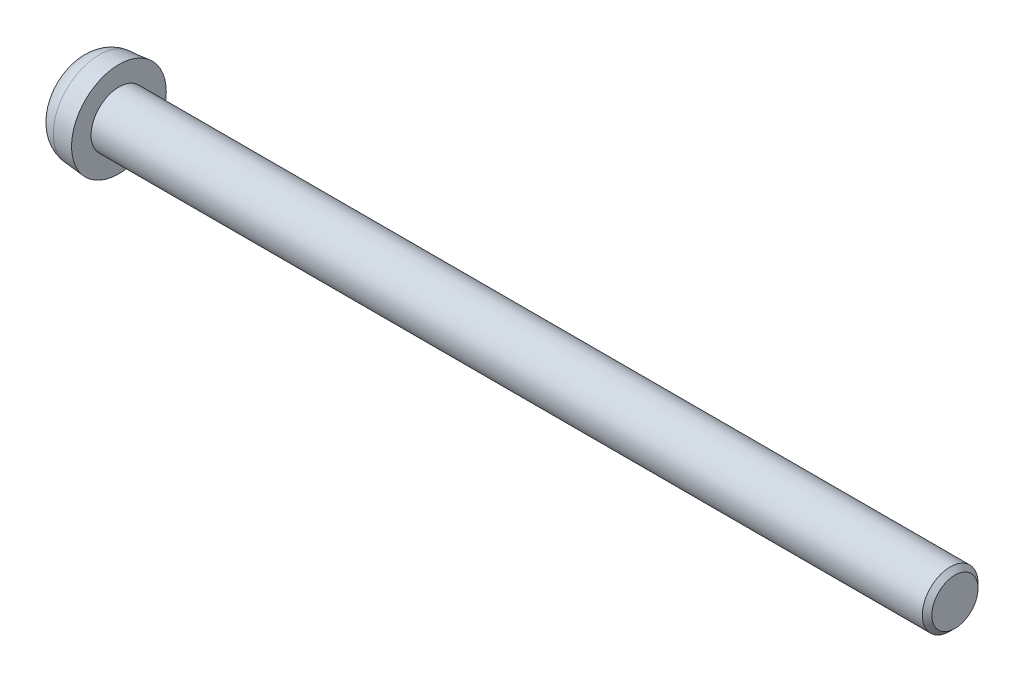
ISO-10303-21;
HEADER;
FILE_DESCRIPTION(('STEP AP214'),'2;1');
FILE_NAME('part.step','',(''),(''),'','','');
FILE_SCHEMA(('AUTOMOTIVE_DESIGN { 1 0 10303 214 1 1 1 1 }'));
ENDSEC;
DATA;
#1=APPLICATION_CONTEXT('core data for automotive mechanical design processes');
#2=APPLICATION_PROTOCOL_DEFINITION('international standard','automotive_design',2000,#1);
#3=PRODUCT_CONTEXT('',#1,'mechanical');
#4=PRODUCT('Part','Part','',(#3));
#5=PRODUCT_RELATED_PRODUCT_CATEGORY('part','',(#4));
#6=PRODUCT_DEFINITION_FORMATION('','',#4);
#7=PRODUCT_DEFINITION_CONTEXT('part definition',#1,'design');
#8=PRODUCT_DEFINITION('design','',#6,#7);
#9=PRODUCT_DEFINITION_SHAPE('','',#8);
#10=(LENGTH_UNIT() NAMED_UNIT(*) SI_UNIT(.MILLI.,.METRE.));
#11=(NAMED_UNIT(*) PLANE_ANGLE_UNIT() SI_UNIT($,.RADIAN.));
#12=(NAMED_UNIT(*) SI_UNIT($,.STERADIAN.) SOLID_ANGLE_UNIT());
#13=UNCERTAINTY_MEASURE_WITH_UNIT(LENGTH_MEASURE(1.E-05),#10,'distance_accuracy_value','');
#14=(GEOMETRIC_REPRESENTATION_CONTEXT(3) GLOBAL_UNCERTAINTY_ASSIGNED_CONTEXT((#13)) GLOBAL_UNIT_ASSIGNED_CONTEXT((#10,
#11,#12)) REPRESENTATION_CONTEXT('',''));
#15=CARTESIAN_POINT('',(0.,0.,0.));
#16=DIRECTION('',(0.,0.,1.));
#17=DIRECTION('',(1.,0.,0.));
#18=AXIS2_PLACEMENT_3D('',#15,#16,#17);
#19=CARTESIAN_POINT('',(-0.257002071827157,0.2375,-0.2375));
#20=DIRECTION('',(0.795355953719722,0.,-0.606142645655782));
#21=DIRECTION('',(-0.606142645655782,0.,-0.795355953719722));
#22=AXIS2_PLACEMENT_3D('',#19,#20,#21);
#23=PLANE('',#22);
#24=DIRECTION('',(-0.606142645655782,0.,-0.795355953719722));
#25=VECTOR('',#24,1.);
#26=CARTESIAN_POINT('',(-0.257002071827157,0.2375,-0.2375));
#27=LINE('',#26,#25);
#28=CARTESIAN_POINT('',(-0.257002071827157,0.2375,-0.2375));
#29=VERTEX_POINT('',#28);
#30=CARTESIAN_POINT('',(-0.8,0.2375,-0.95));
#31=VERTEX_POINT('',#30);
#32=EDGE_CURVE('E272',#29,#31,#27,.T.);
#33=ORIENTED_EDGE('',*,*,#32,.T.);
#34=DIRECTION('',(0.,1.,0.));
#35=VECTOR('',#34,1.);
#36=CARTESIAN_POINT('',(-0.8,0.2375,-0.95));
#37=LINE('',#36,#35);
#38=CARTESIAN_POINT('',(-0.8,-0.2375,-0.95));
#39=VERTEX_POINT('',#38);
#40=EDGE_CURVE('E173',#31,#39,#37,.F.);
#41=ORIENTED_EDGE('',*,*,#40,.T.);
#42=DIRECTION('',(-0.606142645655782,0.,-0.795355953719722));
#43=VECTOR('',#42,1.);
#44=CARTESIAN_POINT('',(-0.257002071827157,-0.2375,-0.2375));
#45=LINE('',#44,#43);
#46=CARTESIAN_POINT('',(-0.257002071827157,-0.2375,-0.2375));
#47=VERTEX_POINT('',#46);
#48=EDGE_CURVE('E170',#47,#39,#45,.T.);
#49=ORIENTED_EDGE('',*,*,#48,.F.);
#50=DIRECTION('',(0.,1.,0.));
#51=VECTOR('',#50,1.);
#52=CARTESIAN_POINT('',(-0.257002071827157,0.,-0.2375));
#53=LINE('',#52,#51);
#54=EDGE_CURVE('E277',#29,#47,#53,.F.);
#55=ORIENTED_EDGE('',*,*,#54,.F.);
#56=EDGE_LOOP('',(#33,#41,#49,#55));
#57=FACE_BOUND('',#56,.T.);
#58=ADVANCED_FACE('F17',(#57),#23,.F.);
#59=CARTESIAN_POINT('',(-0.8,-0.95,0.2375));
#60=DIRECTION('',(0.792405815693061,-0.609994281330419,0.));
#61=DIRECTION('',(0.609994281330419,0.792405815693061,0.));
#62=AXIS2_PLACEMENT_3D('',#59,#60,#61);
#63=PLANE('',#62);
#64=DIRECTION('',(0.609994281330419,0.792405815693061,0.));
#65=VECTOR('',#64,1.);
#66=CARTESIAN_POINT('',(-0.8,-0.95,0.2375));
#67=LINE('',#66,#65);
#68=CARTESIAN_POINT('',(-0.8,-0.95,0.2375));
#69=VERTEX_POINT('',#68);
#70=CARTESIAN_POINT('',(-0.251517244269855,-0.2375,0.2375));
#71=VERTEX_POINT('',#70);
#72=EDGE_CURVE('E144',#69,#71,#67,.T.);
#73=ORIENTED_EDGE('',*,*,#72,.T.);
#74=DIRECTION('',(0.,0.,-1.));
#75=VECTOR('',#74,1.);
#76=CARTESIAN_POINT('',(-0.251517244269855,-0.2375,0.2375));
#77=LINE('',#76,#75);
#78=CARTESIAN_POINT('',(-0.251517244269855,-0.2375,-0.2375));
#79=VERTEX_POINT('',#78);
#80=EDGE_CURVE('E137',#71,#79,#77,.T.);
#81=ORIENTED_EDGE('',*,*,#80,.T.);
#82=DIRECTION('',(0.609994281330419,0.792405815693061,0.));
#83=VECTOR('',#82,1.);
#84=CARTESIAN_POINT('',(-0.8,-0.95,-0.2375));
#85=LINE('',#84,#83);
#86=CARTESIAN_POINT('',(-0.8,-0.95,-0.2375));
#87=VERTEX_POINT('',#86);
#88=EDGE_CURVE('E141',#87,#79,#85,.T.);
#89=ORIENTED_EDGE('',*,*,#88,.F.);
#90=DIRECTION('',(0.,0.,-1.));
#91=VECTOR('',#90,1.);
#92=CARTESIAN_POINT('',(-0.8,-0.95,0.2375));
#93=LINE('',#92,#91);
#94=EDGE_CURVE('E174',#87,#69,#93,.F.);
#95=ORIENTED_EDGE('',*,*,#94,.T.);
#96=EDGE_LOOP('',(#73,#81,#89,#95));
#97=FACE_BOUND('',#96,.T.);
#98=ADVANCED_FACE('F139',(#97),#63,.F.);
#99=CARTESIAN_POINT('',(-0.251517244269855,-0.2375,0.2375));
#100=DIRECTION('',(1.,0.,0.));
#101=DIRECTION('',(0.,0.,-1.));
#102=AXIS2_PLACEMENT_3D('',#99,#100,#101);
#103=PLANE('',#102);
#104=DIRECTION('',(0.,1.,0.));
#105=VECTOR('',#104,1.);
#106=CARTESIAN_POINT('',(-0.251517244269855,0.,0.2375));
#107=LINE('',#106,#105);
#108=CARTESIAN_POINT('',(-0.251517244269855,0.2375,0.2375));
#109=VERTEX_POINT('',#108);
#110=EDGE_CURVE('E251',#71,#109,#107,.T.);
#111=ORIENTED_EDGE('',*,*,#110,.T.);
#112=DIRECTION('',(0.,0.,1.));
#113=VECTOR('',#112,1.);
#114=CARTESIAN_POINT('',(-0.251517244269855,0.2375,0.2375));
#115=LINE('',#114,#113);
#116=CARTESIAN_POINT('',(-0.251517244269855,0.2375,-0.2375));
#117=VERTEX_POINT('',#116);
#118=EDGE_CURVE('E147',#109,#117,#115,.F.);
#119=ORIENTED_EDGE('',*,*,#118,.T.);
#120=DIRECTION('',(0.,1.,0.));
#121=VECTOR('',#120,1.);
#122=CARTESIAN_POINT('',(-0.251517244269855,0.,-0.2375));
#123=LINE('',#122,#121);
#124=EDGE_CURVE('E150',#79,#117,#123,.T.);
#125=ORIENTED_EDGE('',*,*,#124,.F.);
#126=ORIENTED_EDGE('',*,*,#80,.F.);
#127=EDGE_LOOP('',(#111,#119,#125,#126));
#128=FACE_BOUND('',#127,.T.);
#129=ADVANCED_FACE('F151',(#128),#103,.F.);
#130=CARTESIAN_POINT('',(-0.251517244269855,0.2375,0.2375));
#131=DIRECTION('',(0.792405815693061,0.609994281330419,0.));
#132=DIRECTION('',(-0.609994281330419,0.792405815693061,0.));
#133=AXIS2_PLACEMENT_3D('',#130,#131,#132);
#134=PLANE('',#133);
#135=DIRECTION('',(-0.609994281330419,0.792405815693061,0.));
#136=VECTOR('',#135,1.);
#137=CARTESIAN_POINT('',(-0.251517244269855,0.2375,0.2375));
#138=LINE('',#137,#136);
#139=CARTESIAN_POINT('',(-0.8,0.95,0.2375));
#140=VERTEX_POINT('',#139);
#141=EDGE_CURVE('E249',#109,#140,#138,.T.);
#142=ORIENTED_EDGE('',*,*,#141,.T.);
#143=DIRECTION('',(0.,0.,1.));
#144=VECTOR('',#143,1.);
#145=CARTESIAN_POINT('',(-0.8,0.95,0.2375));
#146=LINE('',#145,#144);
#147=CARTESIAN_POINT('',(-0.8,0.95,-0.2375));
#148=VERTEX_POINT('',#147);
#149=EDGE_CURVE('E243',#140,#148,#146,.F.);
#150=ORIENTED_EDGE('',*,*,#149,.T.);
#151=DIRECTION('',(-0.609994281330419,0.792405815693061,0.));
#152=VECTOR('',#151,1.);
#153=CARTESIAN_POINT('',(-0.251517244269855,0.2375,-0.2375));
#154=LINE('',#153,#152);
#155=EDGE_CURVE('E156',#117,#148,#154,.T.);
#156=ORIENTED_EDGE('',*,*,#155,.F.);
#157=ORIENTED_EDGE('',*,*,#118,.F.);
#158=EDGE_LOOP('',(#142,#150,#156,#157));
#159=FACE_BOUND('',#158,.T.);
#160=ADVANCED_FACE('F457',(#159),#134,.F.);
#161=CARTESIAN_POINT('',(-0.8,0.2375,0.95));
#162=DIRECTION('',(0.795355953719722,0.,0.606142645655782));
#163=DIRECTION('',(0.606142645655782,0.,-0.795355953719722));
#164=AXIS2_PLACEMENT_3D('',#161,#162,#163);
#165=PLANE('',#164);
#166=DIRECTION('',(0.606142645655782,0.,-0.795355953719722));
#167=VECTOR('',#166,1.);
#168=CARTESIAN_POINT('',(-0.8,0.2375,0.95));
#169=LINE('',#168,#167);
#170=CARTESIAN_POINT('',(-0.8,0.2375,0.95));
#171=VERTEX_POINT('',#170);
#172=CARTESIAN_POINT('',(-0.257002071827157,0.2375,0.2375));
#173=VERTEX_POINT('',#172);
#174=EDGE_CURVE('E224',#171,#173,#169,.T.);
#175=ORIENTED_EDGE('',*,*,#174,.T.);
#176=DIRECTION('',(0.,1.,0.));
#177=VECTOR('',#176,1.);
#178=CARTESIAN_POINT('',(-0.257002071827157,0.,0.2375));
#179=LINE('',#178,#177);
#180=CARTESIAN_POINT('',(-0.257002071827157,-0.2375,0.2375));
#181=VERTEX_POINT('',#180);
#182=EDGE_CURVE('E237',#173,#181,#179,.F.);
#183=ORIENTED_EDGE('',*,*,#182,.T.);
#184=DIRECTION('',(0.606142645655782,0.,-0.795355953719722));
#185=VECTOR('',#184,1.);
#186=CARTESIAN_POINT('',(-0.8,-0.2375,0.95));
#187=LINE('',#186,#185);
#188=CARTESIAN_POINT('',(-0.8,-0.2375,0.95));
#189=VERTEX_POINT('',#188);
#190=EDGE_CURVE('E233',#189,#181,#187,.T.);
#191=ORIENTED_EDGE('',*,*,#190,.F.);
#192=DIRECTION('',(0.,1.,0.));
#193=VECTOR('',#192,1.);
#194=CARTESIAN_POINT('',(-0.8,0.2375,0.95));
#195=LINE('',#194,#193);
#196=EDGE_CURVE('E94',#189,#171,#195,.T.);
#197=ORIENTED_EDGE('',*,*,#196,.T.);
#198=EDGE_LOOP('',(#175,#183,#191,#197));
#199=FACE_BOUND('',#198,.T.);
#200=ADVANCED_FACE('F454',(#199),#165,.F.);
#201=CARTESIAN_POINT('',(0.,-0.2375,0.));
#202=DIRECTION('',(0.,1.,0.));
#203=DIRECTION('',(0.,0.,1.));
#204=AXIS2_PLACEMENT_3D('',#201,#202,#203);
#205=PLANE('',#204);
#206=ORIENTED_EDGE('',*,*,#190,.T.);
#207=DIRECTION('',(1.,0.,0.));
#208=VECTOR('',#207,1.);
#209=CARTESIAN_POINT('',(0.,-0.2375,0.2375));
#210=LINE('',#209,#208);
#211=CARTESIAN_POINT('',(-1.58232422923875,-0.2375,0.2375));
#212=VERTEX_POINT('',#211);
#213=EDGE_CURVE('E78',#181,#212,#210,.F.);
#214=ORIENTED_EDGE('',*,*,#213,.T.);
#215=CARTESIAN_POINT('',(-1.44648875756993,-0.2375,0.950000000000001));
#216=CARTESIAN_POINT('',(-1.47856979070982,-0.237500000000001,0.847213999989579));
#217=CARTESIAN_POINT('',(-1.50540901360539,-0.237500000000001,0.742751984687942));
#218=CARTESIAN_POINT('',(-1.54828837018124,-0.237499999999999,0.532255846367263));
#219=CARTESIAN_POINT('',(-1.56438930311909,-0.237499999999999,0.426234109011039));
#220=CARTESIAN_POINT('',(-1.57787557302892,-0.237499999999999,0.292340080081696));
#221=CARTESIAN_POINT('',(-1.58027812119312,-0.237499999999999,0.264931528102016));
#222=CARTESIAN_POINT('',(-1.58232422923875,-0.2375,0.237499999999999));
#223=B_SPLINE_CURVE_WITH_KNOTS('',3,(#215,#216,#217,#218,#219,#220,#221,#222),.UNSPECIFIED.,.F.,
.F.,(4,2,2,4),(0.,0.322970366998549,0.644096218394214,0.726627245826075),.UNSPECIFIED.);
#224=CARTESIAN_POINT('',(-1.44648875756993,-0.2375,0.950000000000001));
#225=VERTEX_POINT('',#224);
#226=EDGE_CURVE('E21',#225,#212,#223,.T.);
#227=ORIENTED_EDGE('',*,*,#226,.F.);
#228=DIRECTION('',(1.,0.,0.));
#229=VECTOR('',#228,1.);
#230=CARTESIAN_POINT('',(-1.68,-0.2375,0.95));
#231=LINE('',#230,#229);
#232=EDGE_CURVE('E226',#225,#189,#231,.T.);
#233=ORIENTED_EDGE('',*,*,#232,.T.);
#234=EDGE_LOOP('',(#206,#214,#227,#233));
#235=FACE_BOUND('',#234,.T.);
#236=ADVANCED_FACE('F320',(#235),#205,.T.);
#237=CARTESIAN_POINT('',(-1.76,-0.95,0.2375));
#238=DIRECTION('',(0.,-1.,0.));
#239=DIRECTION('',(0.,0.,-1.));
#240=AXIS2_PLACEMENT_3D('',#237,#238,#239);
#241=PLANE('',#240);
#242=ORIENTED_EDGE('',*,*,#94,.F.);
#243=DIRECTION('',(1.,0.,0.));
#244=VECTOR('',#243,1.);
#245=CARTESIAN_POINT('',(0.,-0.95,-0.2375));
#246=LINE('',#245,#244);
#247=CARTESIAN_POINT('',(-1.44648875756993,-0.950000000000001,-0.2375));
#248=VERTEX_POINT('',#247);
#249=EDGE_CURVE('E161',#248,#87,#246,.T.);
#250=ORIENTED_EDGE('',*,*,#249,.F.);
#251=CARTESIAN_POINT('',(-1.44648875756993,-0.95,0.2375));
#252=CARTESIAN_POINT('',(-1.45265113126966,-0.95,0.158333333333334));
#253=CARTESIAN_POINT('',(-1.45573231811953,-0.95,0.0791666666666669));
#254=CARTESIAN_POINT('',(-1.45573231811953,-0.95,-0.0791666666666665));
#255=CARTESIAN_POINT('',(-1.45265113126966,-0.95,-0.158333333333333));
#256=CARTESIAN_POINT('',(-1.44648875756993,-0.95,-0.2375));
#257=B_SPLINE_CURVE_WITH_KNOTS('',3,(#251,#252,#253,#254,#255,#256),.UNSPECIFIED.,.F.,.F.,(4,2,
4),(0.,0.237679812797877,0.475359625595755),.UNSPECIFIED.);
#258=CARTESIAN_POINT('',(-1.44648875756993,-0.95,0.2375));
#259=VERTEX_POINT('',#258);
#260=EDGE_CURVE('E357',#259,#248,#257,.T.);
#261=ORIENTED_EDGE('',*,*,#260,.F.);
#262=DIRECTION('',(1.,0.,0.));
#263=VECTOR('',#262,1.);
#264=CARTESIAN_POINT('',(0.,-0.95,0.2375));
#265=LINE('',#264,#263);
#266=EDGE_CURVE('E263',#259,#69,#265,.T.);
#267=ORIENTED_EDGE('',*,*,#266,.T.);
#268=EDGE_LOOP('',(#242,#250,#261,#267));
#269=FACE_BOUND('',#268,.T.);
#270=ADVANCED_FACE('F369',(#269),#241,.F.);
#271=CARTESIAN_POINT('',(0.,-0.2375,0.));
#272=DIRECTION('',(0.,1.,0.));
#273=DIRECTION('',(0.,0.,1.));
#274=AXIS2_PLACEMENT_3D('',#271,#272,#273);
#275=PLANE('',#274);
#276=CARTESIAN_POINT('',(-1.58232422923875,-0.2375,-0.237500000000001));
#277=CARTESIAN_POINT('',(-1.57433797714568,-0.2375,-0.344879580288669));
#278=CARTESIAN_POINT('',(-1.56086094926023,-0.2375,-0.451889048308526));
#279=CARTESIAN_POINT('',(-1.52328687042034,-0.2375,-0.66339661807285));
#280=CARTESIAN_POINT('',(-1.49925091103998,-0.2375,-0.767905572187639));
#281=CARTESIAN_POINT('',(-1.46252891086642,-0.2375,-0.897369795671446));
#282=CARTESIAN_POINT('',(-1.4546787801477,-0.2375,-0.923739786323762));
#283=CARTESIAN_POINT('',(-1.44648875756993,-0.2375,-0.950000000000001));
#284=B_SPLINE_CURVE_WITH_KNOTS('',3,(#276,#277,#278,#279,#280,#281,#282,#283),.UNSPECIFIED.,.F.,
.F.,(4,2,2,4),(0.,0.322970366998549,0.644096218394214,0.726627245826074),.UNSPECIFIED.);
#285=CARTESIAN_POINT('',(-1.58232422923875,-0.2375,-0.2375));
#286=VERTEX_POINT('',#285);
#287=CARTESIAN_POINT('',(-1.44648875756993,-0.2375,-0.95));
#288=VERTEX_POINT('',#287);
#289=EDGE_CURVE('E384',#286,#288,#284,.T.);
#290=ORIENTED_EDGE('',*,*,#289,.F.);
#291=DIRECTION('',(1.,0.,0.));
#292=VECTOR('',#291,1.);
#293=CARTESIAN_POINT('',(0.,-0.2375,-0.2375));
#294=LINE('',#293,#292);
#295=EDGE_CURVE('E163',#47,#286,#294,.F.);
#296=ORIENTED_EDGE('',*,*,#295,.F.);
#297=ORIENTED_EDGE('',*,*,#48,.T.);
#298=DIRECTION('',(-1.,0.,0.));
#299=VECTOR('',#298,1.);
#300=CARTESIAN_POINT('',(-0.8,-0.2375,-0.95));
#301=LINE('',#300,#299);
#302=EDGE_CURVE('E178',#39,#288,#301,.T.);
#303=ORIENTED_EDGE('',*,*,#302,.T.);
#304=EDGE_LOOP('',(#290,#296,#297,#303));
#305=FACE_BOUND('',#304,.T.);
#306=ADVANCED_FACE('F373',(#305),#275,.T.);
#307=CARTESIAN_POINT('',(-0.8,0.2375,-0.95));
#308=DIRECTION('',(0.,0.,-1.));
#309=DIRECTION('',(-1.,0.,0.));
#310=AXIS2_PLACEMENT_3D('',#307,#308,#309);
#311=PLANE('',#310);
#312=CARTESIAN_POINT('',(-1.44648875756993,-0.2375,-0.95));
#313=CARTESIAN_POINT('',(-1.45265113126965,-0.158333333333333,-0.95));
#314=CARTESIAN_POINT('',(-1.4557323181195,-0.0791666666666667,-0.950000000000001));
#315=CARTESIAN_POINT('',(-1.4557323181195,0.0791666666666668,-0.950000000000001));
#316=CARTESIAN_POINT('',(-1.45265113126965,0.158333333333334,-0.95));
#317=CARTESIAN_POINT('',(-1.44648875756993,0.2375,-0.95));
#318=B_SPLINE_CURVE_WITH_KNOTS('',3,(#312,#313,#314,#315,#316,#317),.UNSPECIFIED.,.F.,.F.,(4,2,
4),(0.,0.237679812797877,0.475359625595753),.UNSPECIFIED.);
#319=CARTESIAN_POINT('',(-1.44648875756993,0.2375,-0.950000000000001));
#320=VERTEX_POINT('',#319);
#321=EDGE_CURVE('E389',#288,#320,#318,.T.);
#322=ORIENTED_EDGE('',*,*,#321,.F.);
#323=ORIENTED_EDGE('',*,*,#302,.F.);
#324=ORIENTED_EDGE('',*,*,#40,.F.);
#325=DIRECTION('',(1.,0.,0.));
#326=VECTOR('',#325,1.);
#327=CARTESIAN_POINT('',(0.,0.2375,-0.95));
#328=LINE('',#327,#326);
#329=EDGE_CURVE('E274',#31,#320,#328,.F.);
#330=ORIENTED_EDGE('',*,*,#329,.T.);
#331=EDGE_LOOP('',(#322,#323,#324,#330));
#332=FACE_BOUND('',#331,.T.);
#333=ADVANCED_FACE('F380',(#332),#311,.F.);
#334=CARTESIAN_POINT('',(0.,0.2375,0.));
#335=DIRECTION('',(0.,1.,0.));
#336=DIRECTION('',(0.,0.,1.));
#337=AXIS2_PLACEMENT_3D('',#334,#335,#336);
#338=PLANE('',#337);
#339=ORIENTED_EDGE('',*,*,#329,.F.);
#340=ORIENTED_EDGE('',*,*,#32,.F.);
#341=DIRECTION('',(1.,0.,0.));
#342=VECTOR('',#341,1.);
#343=CARTESIAN_POINT('',(0.,0.2375,-0.2375));
#344=LINE('',#343,#342);
#345=CARTESIAN_POINT('',(-1.58232422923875,0.2375,-0.2375));
#346=VERTEX_POINT('',#345);
#347=EDGE_CURVE('E246',#346,#29,#344,.T.);
#348=ORIENTED_EDGE('',*,*,#347,.F.);
#349=CARTESIAN_POINT('',(-1.44648875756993,0.2375,-0.950000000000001));
#350=CARTESIAN_POINT('',(-1.47856979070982,0.237500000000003,-0.847213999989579));
#351=CARTESIAN_POINT('',(-1.50540901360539,0.237500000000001,-0.742751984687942));
#352=CARTESIAN_POINT('',(-1.54828837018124,0.237499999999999,-0.532255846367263));
#353=CARTESIAN_POINT('',(-1.56438930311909,0.237499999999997,-0.426234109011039));
#354=CARTESIAN_POINT('',(-1.57787557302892,0.237499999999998,-0.292340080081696));
#355=CARTESIAN_POINT('',(-1.58027812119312,0.237499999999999,-0.264931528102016));
#356=CARTESIAN_POINT('',(-1.58232422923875,0.237499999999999,-0.237499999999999));
#357=B_SPLINE_CURVE_WITH_KNOTS('',3,(#349,#350,#351,#352,#353,#354,#355,#356),.UNSPECIFIED.,.F.,
.F.,(4,2,2,4),(0.,0.322970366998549,0.644096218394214,0.726627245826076),.UNSPECIFIED.);
#358=EDGE_CURVE('E395',#320,#346,#357,.T.);
#359=ORIENTED_EDGE('',*,*,#358,.F.);
#360=EDGE_LOOP('',(#339,#340,#348,#359));
#361=FACE_BOUND('',#360,.T.);
#362=ADVANCED_FACE('F403',(#361),#338,.F.);
#363=CARTESIAN_POINT('',(0.,0.,-0.2375));
#364=DIRECTION('',(0.,0.,1.));
#365=DIRECTION('',(1.,0.,0.));
#366=AXIS2_PLACEMENT_3D('',#363,#364,#365);
#367=PLANE('',#366);
#368=CARTESIAN_POINT('',(-1.58232422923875,0.2375,-0.2375));
#369=CARTESIAN_POINT('',(-1.57433797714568,0.344879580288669,-0.2375));
#370=CARTESIAN_POINT('',(-1.56086094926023,0.451889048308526,-0.2375));
#371=CARTESIAN_POINT('',(-1.52328687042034,0.663396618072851,-0.2375));
#372=CARTESIAN_POINT('',(-1.49925091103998,0.767905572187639,-0.2375));
#373=CARTESIAN_POINT('',(-1.46252891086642,0.897369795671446,-0.2375));
#374=CARTESIAN_POINT('',(-1.4546787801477,0.923739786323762,-0.2375));
#375=CARTESIAN_POINT('',(-1.44648875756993,0.950000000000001,-0.2375));
#376=B_SPLINE_CURVE_WITH_KNOTS('',3,(#368,#369,#370,#371,#372,#373,#374,#375),.UNSPECIFIED.,.F.,
.F.,(4,2,2,4),(0.,0.322970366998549,0.644096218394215,0.726627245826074),.UNSPECIFIED.);
#377=CARTESIAN_POINT('',(-1.44648875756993,0.95,-0.2375));
#378=VERTEX_POINT('',#377);
#379=EDGE_CURVE('E330',#346,#378,#376,.T.);
#380=ORIENTED_EDGE('',*,*,#379,.F.);
#381=ORIENTED_EDGE('',*,*,#347,.T.);
#382=ORIENTED_EDGE('',*,*,#54,.T.);
#383=ORIENTED_EDGE('',*,*,#295,.T.);
#384=CARTESIAN_POINT('',(-1.44648875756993,-0.950000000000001,-0.2375));
#385=CARTESIAN_POINT('',(-1.47856979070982,-0.847213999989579,-0.237500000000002));
#386=CARTESIAN_POINT('',(-1.50540901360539,-0.742751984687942,-0.237500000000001));
#387=CARTESIAN_POINT('',(-1.54828837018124,-0.532255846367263,-0.237499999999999));
#388=CARTESIAN_POINT('',(-1.56438930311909,-0.426234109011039,-0.237499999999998));
#389=CARTESIAN_POINT('',(-1.57787557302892,-0.292340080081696,-0.237499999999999));
#390=CARTESIAN_POINT('',(-1.58027812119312,-0.264931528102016,-0.237499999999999));
#391=CARTESIAN_POINT('',(-1.58232422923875,-0.237499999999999,-0.2375));
#392=B_SPLINE_CURVE_WITH_KNOTS('',3,(#384,#385,#386,#387,#388,#389,#390,#391),.UNSPECIFIED.,.F.,
.F.,(4,2,2,4),(0.,0.322970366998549,0.644096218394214,0.726627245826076),.UNSPECIFIED.);
#393=EDGE_CURVE('E364',#248,#286,#392,.T.);
#394=ORIENTED_EDGE('',*,*,#393,.F.);
#395=ORIENTED_EDGE('',*,*,#249,.T.);
#396=ORIENTED_EDGE('',*,*,#88,.T.);
#397=ORIENTED_EDGE('',*,*,#124,.T.);
#398=ORIENTED_EDGE('',*,*,#155,.T.);
#399=DIRECTION('',(1.,0.,0.));
#400=VECTOR('',#399,1.);
#401=CARTESIAN_POINT('',(-0.8,0.95,-0.2375));
#402=LINE('',#401,#400);
#403=EDGE_CURVE('E245',#148,#378,#402,.F.);
#404=ORIENTED_EDGE('',*,*,#403,.T.);
#405=EDGE_LOOP('',(#380,#381,#382,#383,#394,#395,#396,#397,#398,#404));
#406=FACE_BOUND('',#405,.T.);
#407=ADVANCED_FACE('F159',(#406),#367,.T.);
#408=CARTESIAN_POINT('',(-0.8,0.95,0.2375));
#409=DIRECTION('',(0.,1.,0.));
#410=DIRECTION('',(0.,0.,1.));
#411=AXIS2_PLACEMENT_3D('',#408,#409,#410);
#412=PLANE('',#411);
#413=ORIENTED_EDGE('',*,*,#149,.F.);
#414=DIRECTION('',(1.,0.,0.));
#415=VECTOR('',#414,1.);
#416=CARTESIAN_POINT('',(0.,0.95,0.2375));
#417=LINE('',#416,#415);
#418=CARTESIAN_POINT('',(-1.44648875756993,0.950000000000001,0.2375));
#419=VERTEX_POINT('',#418);
#420=EDGE_CURVE('E240',#140,#419,#417,.F.);
#421=ORIENTED_EDGE('',*,*,#420,.T.);
#422=CARTESIAN_POINT('',(-1.44648875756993,0.95,-0.2375));
#423=CARTESIAN_POINT('',(-1.45265113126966,0.95,-0.158333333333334));
#424=CARTESIAN_POINT('',(-1.45573231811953,0.95,-0.0791666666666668));
#425=CARTESIAN_POINT('',(-1.45573231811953,0.95,0.0791666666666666));
#426=CARTESIAN_POINT('',(-1.45265113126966,0.95,0.158333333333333));
#427=CARTESIAN_POINT('',(-1.44648875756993,0.95,0.2375));
#428=B_SPLINE_CURVE_WITH_KNOTS('',3,(#422,#423,#424,#425,#426,#427),.UNSPECIFIED.,.F.,.F.,(4,2,
4),(0.,0.237679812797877,0.475359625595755),.UNSPECIFIED.);
#429=EDGE_CURVE('E329',#378,#419,#428,.T.);
#430=ORIENTED_EDGE('',*,*,#429,.F.);
#431=ORIENTED_EDGE('',*,*,#403,.F.);
#432=EDGE_LOOP('',(#413,#421,#430,#431));
#433=FACE_BOUND('',#432,.T.);
#434=ADVANCED_FACE('F345',(#433),#412,.F.);
#435=CARTESIAN_POINT('',(0.,0.,0.2375));
#436=DIRECTION('',(0.,0.,1.));
#437=DIRECTION('',(1.,0.,0.));
#438=AXIS2_PLACEMENT_3D('',#435,#436,#437);
#439=PLANE('',#438);
#440=DIRECTION('',(1.,0.,0.));
#441=VECTOR('',#440,1.);
#442=CARTESIAN_POINT('',(0.,0.2375,0.2375));
#443=LINE('',#442,#441);
#444=CARTESIAN_POINT('',(-1.58232422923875,0.2375,0.2375));
#445=VERTEX_POINT('',#444);
#446=EDGE_CURVE('E227',#173,#445,#443,.F.);
#447=ORIENTED_EDGE('',*,*,#446,.T.);
#448=CARTESIAN_POINT('',(-1.44648875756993,0.950000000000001,0.2375));
#449=CARTESIAN_POINT('',(-1.47856979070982,0.847213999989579,0.237500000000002));
#450=CARTESIAN_POINT('',(-1.50540901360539,0.742751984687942,0.237500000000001));
#451=CARTESIAN_POINT('',(-1.54828837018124,0.532255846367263,0.237499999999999));
#452=CARTESIAN_POINT('',(-1.56438930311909,0.426234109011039,0.237499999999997));
#453=CARTESIAN_POINT('',(-1.57787557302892,0.292340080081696,0.237499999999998));
#454=CARTESIAN_POINT('',(-1.58027812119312,0.264931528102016,0.237499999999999));
#455=CARTESIAN_POINT('',(-1.58232422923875,0.237499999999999,0.237499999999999));
#456=B_SPLINE_CURVE_WITH_KNOTS('',3,(#448,#449,#450,#451,#452,#453,#454,#455),.UNSPECIFIED.,.F.,
.F.,(4,2,2,4),(0.,0.322970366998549,0.644096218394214,0.726627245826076),.UNSPECIFIED.);
#457=EDGE_CURVE('E327',#419,#445,#456,.T.);
#458=ORIENTED_EDGE('',*,*,#457,.F.);
#459=ORIENTED_EDGE('',*,*,#420,.F.);
#460=ORIENTED_EDGE('',*,*,#141,.F.);
#461=ORIENTED_EDGE('',*,*,#110,.F.);
#462=ORIENTED_EDGE('',*,*,#72,.F.);
#463=ORIENTED_EDGE('',*,*,#266,.F.);
#464=CARTESIAN_POINT('',(-1.58232422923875,-0.2375,0.237500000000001));
#465=CARTESIAN_POINT('',(-1.57433797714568,-0.344879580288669,0.2375));
#466=CARTESIAN_POINT('',(-1.56086094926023,-0.451889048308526,0.2375));
#467=CARTESIAN_POINT('',(-1.52328687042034,-0.663396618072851,0.2375));
#468=CARTESIAN_POINT('',(-1.49925091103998,-0.767905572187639,0.2375));
#469=CARTESIAN_POINT('',(-1.46252891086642,-0.897369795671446,0.2375));
#470=CARTESIAN_POINT('',(-1.4546787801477,-0.923739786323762,0.2375));
#471=CARTESIAN_POINT('',(-1.44648875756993,-0.950000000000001,0.2375));
#472=B_SPLINE_CURVE_WITH_KNOTS('',3,(#464,#465,#466,#467,#468,#469,#470,#471),.UNSPECIFIED.,.F.,
.F.,(4,2,2,4),(0.,0.322970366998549,0.644096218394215,0.726627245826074),.UNSPECIFIED.);
#473=EDGE_CURVE('E351',#212,#259,#472,.T.);
#474=ORIENTED_EDGE('',*,*,#473,.F.);
#475=ORIENTED_EDGE('',*,*,#213,.F.);
#476=ORIENTED_EDGE('',*,*,#182,.F.);
#477=EDGE_LOOP('',(#447,#458,#459,#460,#461,#462,#463,#474,#475,#476));
#478=FACE_BOUND('',#477,.T.);
#479=ADVANCED_FACE('F341',(#478),#439,.F.);
#480=CARTESIAN_POINT('',(0.,0.2375,0.));
#481=DIRECTION('',(0.,1.,0.));
#482=DIRECTION('',(0.,0.,1.));
#483=AXIS2_PLACEMENT_3D('',#480,#481,#482);
#484=PLANE('',#483);
#485=DIRECTION('',(1.,0.,0.));
#486=VECTOR('',#485,1.);
#487=CARTESIAN_POINT('',(-1.68,0.2375,0.95));
#488=LINE('',#487,#486);
#489=CARTESIAN_POINT('',(-1.44648875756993,0.2375,0.95));
#490=VERTEX_POINT('',#489);
#491=EDGE_CURVE('E41',#171,#490,#488,.F.);
#492=ORIENTED_EDGE('',*,*,#491,.T.);
#493=CARTESIAN_POINT('',(-1.58232422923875,0.2375,0.2375));
#494=CARTESIAN_POINT('',(-1.57433797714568,0.2375,0.344879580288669));
#495=CARTESIAN_POINT('',(-1.56086094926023,0.2375,0.451889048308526));
#496=CARTESIAN_POINT('',(-1.52328687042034,0.2375,0.663396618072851));
#497=CARTESIAN_POINT('',(-1.49925091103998,0.2375,0.767905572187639));
#498=CARTESIAN_POINT('',(-1.46252891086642,0.2375,0.897369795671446));
#499=CARTESIAN_POINT('',(-1.4546787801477,0.2375,0.923739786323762));
#500=CARTESIAN_POINT('',(-1.44648875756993,0.2375,0.950000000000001));
#501=B_SPLINE_CURVE_WITH_KNOTS('',3,(#493,#494,#495,#496,#497,#498,#499,#500),.UNSPECIFIED.,.F.,
.F.,(4,2,2,4),(0.,0.322970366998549,0.644096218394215,0.726627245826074),.UNSPECIFIED.);
#502=EDGE_CURVE('E194',#445,#490,#501,.T.);
#503=ORIENTED_EDGE('',*,*,#502,.F.);
#504=ORIENTED_EDGE('',*,*,#446,.F.);
#505=ORIENTED_EDGE('',*,*,#174,.F.);
#506=EDGE_LOOP('',(#492,#503,#504,#505));
#507=FACE_BOUND('',#506,.T.);
#508=ADVANCED_FACE('F344',(#507),#484,.F.);
#509=CARTESIAN_POINT('',(-1.68,0.2375,0.95));
#510=DIRECTION('',(0.,0.,1.));
#511=DIRECTION('',(1.,0.,0.));
#512=AXIS2_PLACEMENT_3D('',#509,#510,#511);
#513=PLANE('',#512);
#514=CARTESIAN_POINT('',(-1.44648875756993,0.237500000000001,0.95));
#515=CARTESIAN_POINT('',(-1.45265113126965,0.158333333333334,0.949999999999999));
#516=CARTESIAN_POINT('',(-1.4557323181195,0.0791666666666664,0.949999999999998));
#517=CARTESIAN_POINT('',(-1.4557323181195,-0.0791666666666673,0.949999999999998));
#518=CARTESIAN_POINT('',(-1.45265113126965,-0.158333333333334,0.949999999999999));
#519=CARTESIAN_POINT('',(-1.44648875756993,-0.2375,0.95));
#520=B_SPLINE_CURVE_WITH_KNOTS('',3,(#514,#515,#516,#517,#518,#519),.UNSPECIFIED.,.F.,.F.,(4,2,
4),(0.,0.237679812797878,0.475359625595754),.UNSPECIFIED.);
#521=EDGE_CURVE('E85',#490,#225,#520,.T.);
#522=ORIENTED_EDGE('',*,*,#521,.F.);
#523=ORIENTED_EDGE('',*,*,#491,.F.);
#524=ORIENTED_EDGE('',*,*,#196,.F.);
#525=ORIENTED_EDGE('',*,*,#232,.F.);
#526=EDGE_LOOP('',(#522,#523,#524,#525));
#527=FACE_BOUND('',#526,.T.);
#528=ADVANCED_FACE('F200',(#527),#513,.F.);
#529=CARTESIAN_POINT('',(1.6,0.,0.));
#530=DIRECTION('',(1.,0.,0.));
#531=DIRECTION('',(0.,0.,-1.));
#532=AXIS2_PLACEMENT_3D('',#529,#530,#531);
#533=SPHERICAL_SURFACE('',#532,3.2);
#534=ORIENTED_EDGE('',*,*,#289,.T.);
#535=ORIENTED_EDGE('',*,*,#321,.T.);
#536=ORIENTED_EDGE('',*,*,#358,.T.);
#537=ORIENTED_EDGE('',*,*,#379,.T.);
#538=ORIENTED_EDGE('',*,*,#429,.T.);
#539=ORIENTED_EDGE('',*,*,#457,.T.);
#540=ORIENTED_EDGE('',*,*,#502,.T.);
#541=ORIENTED_EDGE('',*,*,#521,.T.);
#542=ORIENTED_EDGE('',*,*,#226,.T.);
#543=ORIENTED_EDGE('',*,*,#473,.T.);
#544=ORIENTED_EDGE('',*,*,#260,.T.);
#545=ORIENTED_EDGE('',*,*,#393,.T.);
#546=EDGE_LOOP('',(#534,#535,#536,#537,#538,#539,#540,#541,#542,#543,#544,#545));
#547=FACE_BOUND('',#546,.T.);
#548=CARTESIAN_POINT('',(-1.39747848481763,0.,0.));
#549=DIRECTION('',(1.,0.,0.));
#550=DIRECTION('',(0.,0.,-1.));
#551=AXIS2_PLACEMENT_3D('',#548,#549,#550);
#552=CIRCLE('',#551,1.12032260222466);
#553=CARTESIAN_POINT('',(-1.39747848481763,0.,-1.12032260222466));
#554=VERTEX_POINT('',#553);
#555=EDGE_CURVE('E193',#554,#554,#552,.T.);
#556=ORIENTED_EDGE('',*,*,#555,.F.);
#557=EDGE_LOOP('',(#556));
#558=FACE_BOUND('',#557,.T.);
#559=ADVANCED_FACE('F202',(#547,#558),#533,.T.);
#560=CARTESIAN_POINT('',(-0.648108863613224,0.,0.));
#561=DIRECTION('',(1.,0.,0.));
#562=DIRECTION('',(0.,0.,-1.));
#563=AXIS2_PLACEMENT_3D('',#560,#561,#562);
#564=TOROIDAL_SURFACE('',#563,0.840241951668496,0.8);
#565=CARTESIAN_POINT('',(-0.717833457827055,0.,0.));
#566=DIRECTION('',(1.,0.,0.));
#567=DIRECTION('',(0.,0.,-1.));
#568=AXIS2_PLACEMENT_3D('',#565,#566,#567);
#569=CIRCLE('',#568,1.63719771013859);
#570=CARTESIAN_POINT('',(-0.717833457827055,0.,-1.63719771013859));
#571=VERTEX_POINT('',#570);
#572=EDGE_CURVE('E187',#571,#571,#569,.T.);
#573=ORIENTED_EDGE('',*,*,#572,.F.);
#574=EDGE_LOOP('',(#573));
#575=FACE_BOUND('',#574,.T.);
#576=ORIENTED_EDGE('',*,*,#555,.T.);
#577=EDGE_LOOP('',(#576));
#578=FACE_BOUND('',#577,.T.);
#579=ADVANCED_FACE('F207',(#575,#578),#564,.T.);
#580=CARTESIAN_POINT('',(30.,0.,0.));
#581=DIRECTION('',(1.,0.,0.));
#582=DIRECTION('',(0.,0.,-1.));
#583=AXIS2_PLACEMENT_3D('',#580,#581,#582);
#584=PLANE('',#583);
#585=CARTESIAN_POINT('',(30.0000000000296,0.,0.));
#586=DIRECTION('',(-1.,0.,0.));
#587=DIRECTION('',(0.,0.,1.));
#588=AXIS2_PLACEMENT_3D('',#585,#586,#587);
#589=CIRCLE('',#588,0.829999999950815);
#590=CARTESIAN_POINT('',(30.0000000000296,0.,0.829999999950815));
#591=VERTEX_POINT('',#590);
#592=EDGE_CURVE('E184',#591,#591,#589,.T.);
#593=ORIENTED_EDGE('',*,*,#592,.F.);
#594=EDGE_LOOP('',(#593));
#595=FACE_BOUND('',#594,.T.);
#596=ADVANCED_FACE('F431',(#595),#584,.T.);
#597=CARTESIAN_POINT('',(-1.70530256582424E-10,0.,0.));
#598=DIRECTION('',(1.,0.,0.));
#599=DIRECTION('',(0.,0.,-1.));
#600=AXIS2_PLACEMENT_3D('',#597,#598,#599);
#601=CONICAL_SURFACE('',#600,1.69999999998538,0.0872664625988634);
#602=CARTESIAN_POINT('',(0.,0.,0.));
#603=DIRECTION('',(1.,0.,0.));
#604=DIRECTION('',(0.,0.,-1.));
#605=AXIS2_PLACEMENT_3D('',#602,#603,#604);
#606=CIRCLE('',#605,1.7000000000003);
#607=CARTESIAN_POINT('',(0.,0.,-1.7000000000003));
#608=VERTEX_POINT('',#607);
#609=EDGE_CURVE('E181',#608,#608,#606,.T.);
#610=ORIENTED_EDGE('',*,*,#609,.F.);
#611=EDGE_LOOP('',(#610));
#612=FACE_BOUND('',#611,.T.);
#613=ORIENTED_EDGE('',*,*,#572,.T.);
#614=EDGE_LOOP('',(#613));
#615=FACE_BOUND('',#614,.T.);
#616=ADVANCED_FACE('F426',(#612,#615),#601,.T.);
#617=CARTESIAN_POINT('',(29.8299999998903,0.,0.));
#618=DIRECTION('',(-1.,0.,0.));
#619=DIRECTION('',(0.,0.,1.));
#620=AXIS2_PLACEMENT_3D('',#617,#618,#619);
#621=CONICAL_SURFACE('',#620,1.00000000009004,0.785398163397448);
#622=ORIENTED_EDGE('',*,*,#592,.T.);
#623=EDGE_LOOP('',(#622));
#624=FACE_BOUND('',#623,.T.);
#625=CARTESIAN_POINT('',(29.83,0.,0.));
#626=DIRECTION('',(-1.,0.,0.));
#627=DIRECTION('',(0.,0.,1.));
#628=AXIS2_PLACEMENT_3D('',#625,#626,#627);
#629=CIRCLE('',#628,1.);
#630=CARTESIAN_POINT('',(29.83,0.,1.));
#631=VERTEX_POINT('',#630);
#632=EDGE_CURVE('E32',#631,#631,#629,.T.);
#633=ORIENTED_EDGE('',*,*,#632,.F.);
#634=EDGE_LOOP('',(#633));
#635=FACE_BOUND('',#634,.T.);
#636=ADVANCED_FACE('F419',(#624,#635),#621,.T.);
#637=CARTESIAN_POINT('',(0.,0.,-1.488625));
#638=DIRECTION('',(1.,0.,0.));
#639=DIRECTION('',(0.,0.,-1.));
#640=AXIS2_PLACEMENT_3D('',#637,#638,#639);
#641=PLANE('',#640);
#642=CARTESIAN_POINT('',(0.,0.,0.));
#643=DIRECTION('',(-1.,0.,0.));
#644=DIRECTION('',(0.,0.,1.));
#645=AXIS2_PLACEMENT_3D('',#642,#643,#644);
#646=CIRCLE('',#645,1.);
#647=CARTESIAN_POINT('',(0.,0.,1.));
#648=VERTEX_POINT('',#647);
#649=EDGE_CURVE('E11',#648,#648,#646,.F.);
#650=ORIENTED_EDGE('',*,*,#649,.F.);
#651=EDGE_LOOP('',(#650));
#652=FACE_BOUND('',#651,.T.);
#653=ORIENTED_EDGE('',*,*,#609,.T.);
#654=EDGE_LOOP('',(#653));
#655=FACE_BOUND('',#654,.T.);
#656=ADVANCED_FACE('F415',(#652,#655),#641,.T.);
#657=CARTESIAN_POINT('',(10.3132026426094,0.,0.));
#658=DIRECTION('',(-1.,0.,0.));
#659=DIRECTION('',(0.,0.,1.));
#660=AXIS2_PLACEMENT_3D('',#657,#658,#659);
#661=CYLINDRICAL_SURFACE('',#660,1.);
#662=ORIENTED_EDGE('',*,*,#649,.T.);
#663=EDGE_LOOP('',(#662));
#664=FACE_BOUND('',#663,.T.);
#665=ORIENTED_EDGE('',*,*,#632,.T.);
#666=EDGE_LOOP('',(#665));
#667=FACE_BOUND('',#666,.T.);
#668=ADVANCED_FACE('F19',(#664,#667),#661,.T.);
#669=CLOSED_SHELL('',(#58,#98,#129,#160,#200,#236,#270,#306,#333,#362,#407,#434,#479,#508,#528,
#559,#579,#596,#616,#636,#656,#668));
#670=MANIFOLD_SOLID_BREP('B1',#669);
#671=ADVANCED_BREP_SHAPE_REPRESENTATION('',(#18,#670),#14);
#672=SHAPE_DEFINITION_REPRESENTATION(#9,#671);
ENDSEC;
END-ISO-10303-21;
